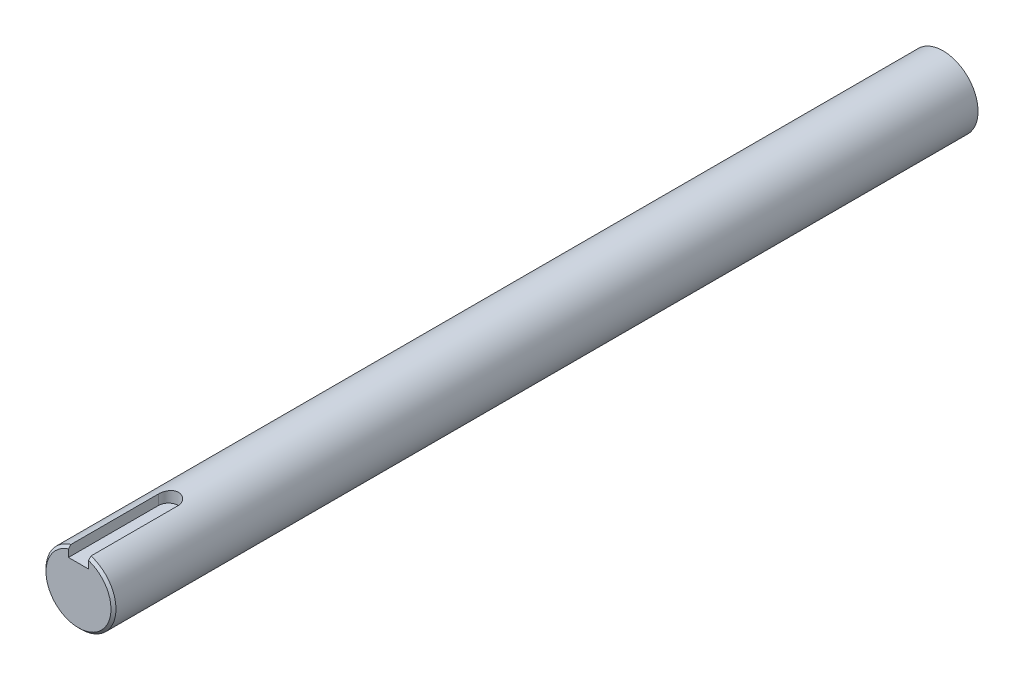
from build123d import *
from build123d.topology import SkipClean

# Parameters (mm, degrees)
EXTRUDE_1_DEPTH      = 98
SKETCH_2_R           = 7
EXTRUDE_4_DEPTH      = 80
CUT_EXTRUDE_20_DEPTH = 80
CHAMFER_1_SIZE       = 0.5
EXTRUDE_START        = 75
SKETCH_7_R           = 7
EXTRUDE_5_DEPTH      = 75


with BuildPart() as part:
    # Sketch 1 → Extrude 1 (new body)
    with BuildSketch(Plane.XY):
        with BuildLine():
            Line((2, 4.7), (-2, 4.7))
            Line((-2, 4.7), (-2, 6.708203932))
            ThreePointArc((-2, 6.708203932), (0, -7), (2, 6.708203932))
            Line((2, 6.708203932), (2, 4.7))
        make_face()
    extrude(amount=EXTRUDE_1_DEPTH)

    # Sketch 2 → Extrude 4 (add)
    with SkipClean():  # the faces are left unmerged after this step: merging them gives an invalid solid
        with BuildSketch(Plane(origin=(0, 0, 0), x_dir=(-1, 0, 0), z_dir=(0, 0, -1))):
            with Locations(Location((0, 0, 0), (0, 0, 73.398450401))):
                Circle(SKETCH_2_R)
        extrude(amount=-EXTRUDE_4_DEPTH)

    # Sketch 6 → Cut-Extrude 20 (cut)
    with SkipClean():  # the faces are left unmerged after this step: merging them gives an invalid solid
        with BuildSketch(Plane(origin=(0, 4.7, 0), x_dir=(1, 0, 0), z_dir=(0, 1, 0))):
            with BuildLine():
                Line((-2, -80), (2, -80))
                ThreePointArc((2, -80), (0, -78), (-2, -80))
            make_face()
        extrude(amount=CUT_EXTRUDE_20_DEPTH, mode=Mode.SUBTRACT)

    # Chamfer 1
    chamfer_1_edges = [part.edges().sort_by_distance(p)[0] for p in [
        (0, -7, 98),
    ]]
    chamfer(chamfer_1_edges, length=CHAMFER_1_SIZE)

    # Sketch 7 → Extrude 5 (add)
    with BuildSketch(Plane(origin=(0, 0, 0), x_dir=(-1, 0, 0), z_dir=(0, 0, -1)).offset(EXTRUDE_START)):
        Circle(SKETCH_7_R)
    extrude(amount=-EXTRUDE_5_DEPTH)


solid = part.part
